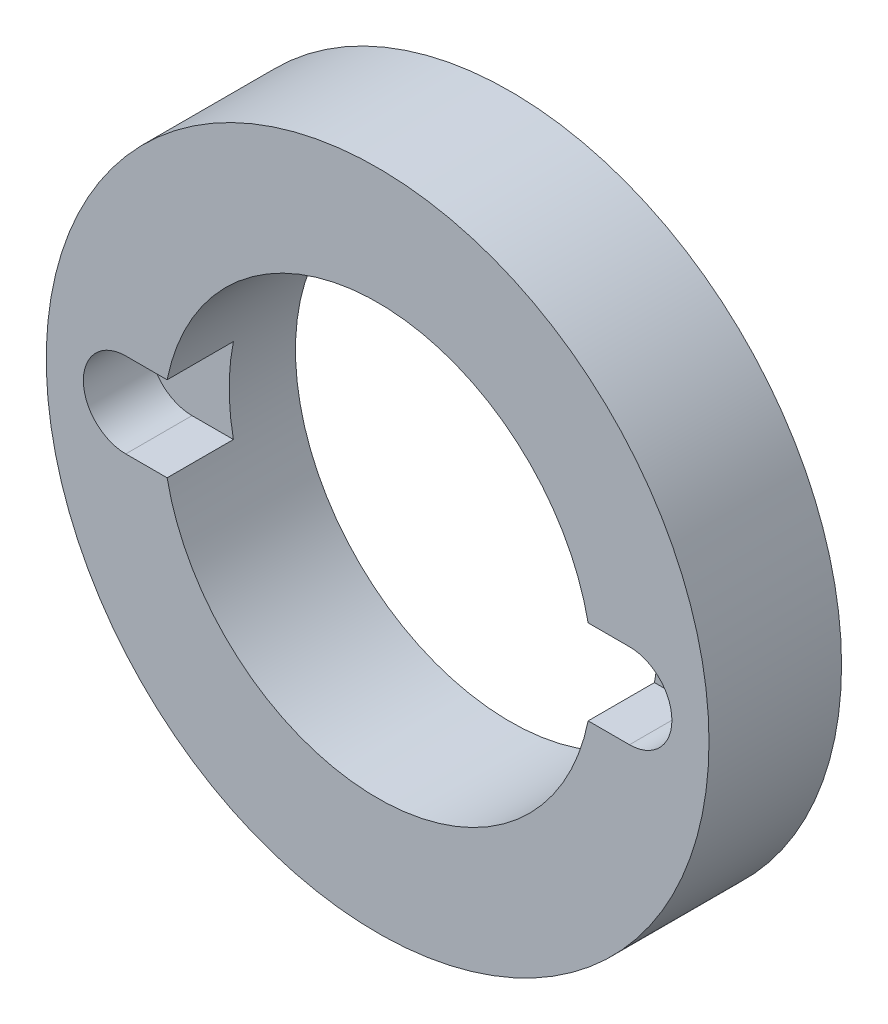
from build123d import *

# Parameters (mm, degrees)
ESQUISSE1_R             = 12.5
EXTRUSION1_DEPTH        = 5
ESQUISSE2_R             = 8.1
ENL_V_MAT_EXTRU_1_DEPTH = 5
ENL_V_MAT_EXTRU_2_DEPTH = 2.5


with BuildPart() as part:
    # Esquisse1 → Extrusion1 (new body)
    with BuildSketch(Plane.XY):
        Circle(ESQUISSE1_R)
    extrude(amount=EXTRUSION1_DEPTH)

    # Esquisse2 → Enl_v. mat.-Extru.1 (cut)
    with BuildSketch(Plane.XY.offset(5)):
        Circle(ESQUISSE2_R)
    extrude(amount=-ENL_V_MAT_EXTRU_1_DEPTH, mode=Mode.SUBTRACT)

    # Esquisse3 → Enl_v. mat.-Extru.2 (cut)
    with BuildSketch(Plane.XY.offset(5)):
        with BuildLine():
            Line((-9.5, 1.6), (9.5, 1.6))
            ThreePointArc((9.5, 1.6), (11.1, 0), (9.5, -1.6))
            Line((9.5, -1.6), (-9.5, -1.6))
            ThreePointArc((-9.5, -1.6), (-11.1, 0), (-9.5, 1.6))
        make_face()
    extrude(amount=-ENL_V_MAT_EXTRU_2_DEPTH, mode=Mode.SUBTRACT)


solid = part.part
